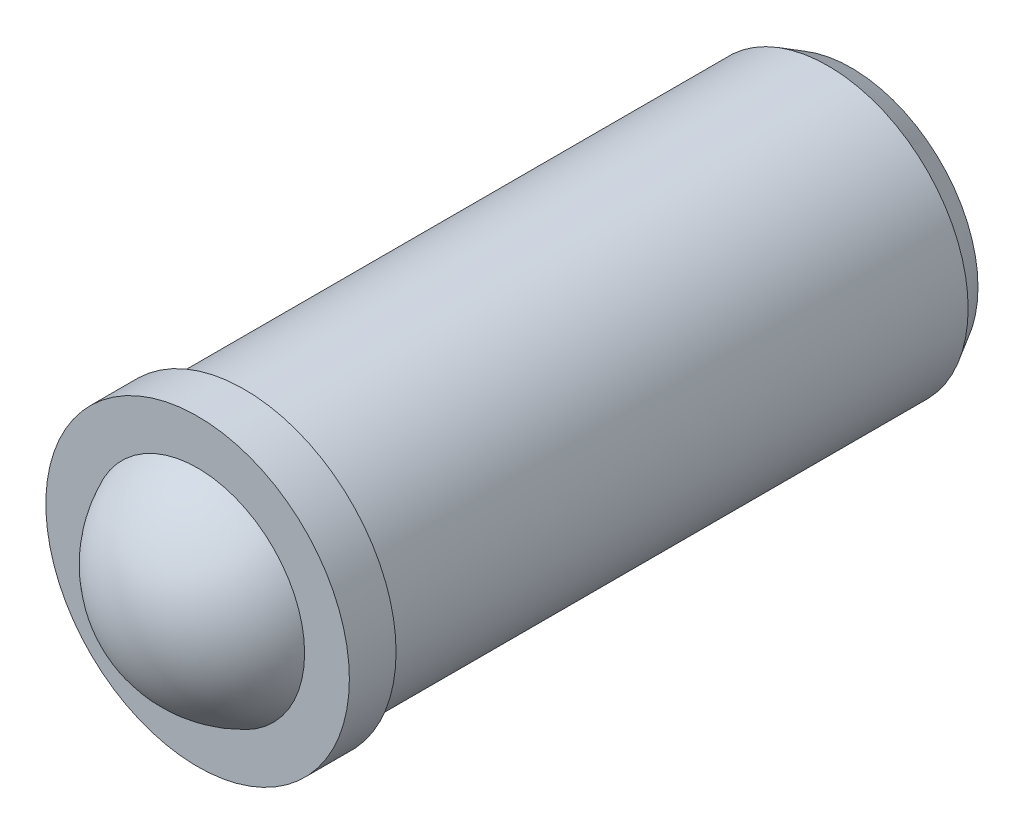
ISO-10303-21;
HEADER;
FILE_DESCRIPTION(('STEP AP214'),'2;1');
FILE_NAME('part.step','',(''),(''),'','','');
FILE_SCHEMA(('AUTOMOTIVE_DESIGN { 1 0 10303 214 1 1 1 1 }'));
ENDSEC;
DATA;
#1=APPLICATION_CONTEXT('core data for automotive mechanical design processes');
#2=APPLICATION_PROTOCOL_DEFINITION('international standard','automotive_design',2000,#1);
#3=PRODUCT_CONTEXT('',#1,'mechanical');
#4=PRODUCT('Part','Part','',(#3));
#5=PRODUCT_RELATED_PRODUCT_CATEGORY('part','',(#4));
#6=PRODUCT_DEFINITION_FORMATION('','',#4);
#7=PRODUCT_DEFINITION_CONTEXT('part definition',#1,'design');
#8=PRODUCT_DEFINITION('design','',#6,#7);
#9=PRODUCT_DEFINITION_SHAPE('','',#8);
#10=(LENGTH_UNIT() NAMED_UNIT(*) SI_UNIT(.MILLI.,.METRE.));
#11=(NAMED_UNIT(*) PLANE_ANGLE_UNIT() SI_UNIT($,.RADIAN.));
#12=(NAMED_UNIT(*) SI_UNIT($,.STERADIAN.) SOLID_ANGLE_UNIT());
#13=UNCERTAINTY_MEASURE_WITH_UNIT(LENGTH_MEASURE(1.E-05),#10,'distance_accuracy_value','');
#14=(GEOMETRIC_REPRESENTATION_CONTEXT(3) GLOBAL_UNCERTAINTY_ASSIGNED_CONTEXT((#13)) GLOBAL_UNIT_ASSIGNED_CONTEXT((#10,
#11,#12)) REPRESENTATION_CONTEXT('',''));
#15=CARTESIAN_POINT('',(0.,0.,0.));
#16=DIRECTION('',(0.,0.,1.));
#17=DIRECTION('',(1.,0.,0.));
#18=AXIS2_PLACEMENT_3D('',#15,#16,#17);
#19=CARTESIAN_POINT('',(0.,0.,0.));
#20=DIRECTION('',(1.,0.,0.));
#21=DIRECTION('',(0.,0.,-1.));
#22=AXIS2_PLACEMENT_3D('',#19,#20,#21);
#23=SPHERICAL_SURFACE('',#22,2.5);
#24=CARTESIAN_POINT('',(0.,0.,0.));
#25=DIRECTION('',(0.,0.,1.));
#26=DIRECTION('',(1.,0.,0.));
#27=AXIS2_PLACEMENT_3D('',#24,#25,#26);
#28=SPHERICAL_SURFACE('',#27,2.5);
#29=CARTESIAN_POINT('',(0.,0.,1.));
#30=DIRECTION('',(0.,0.,1.));
#31=DIRECTION('',(1.,0.,0.));
#32=AXIS2_PLACEMENT_3D('',#29,#30,#31);
#33=CIRCLE('',#32,2.29128784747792);
#34=CARTESIAN_POINT('',(2.29128784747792,0.,1.));
#35=VERTEX_POINT('',#34);
#36=EDGE_CURVE('E26',#35,#35,#33,.T.);
#37=ORIENTED_EDGE('',*,*,#36,.T.);
#38=EDGE_LOOP('',(#37));
#39=FACE_BOUND('',#38,.T.);
#40=ADVANCED_FACE('F12',(#39),#28,.T.);
#41=CARTESIAN_POINT('',(0.,0.,5.));
#42=DIRECTION('',(0.,0.,1.));
#43=DIRECTION('',(1.,0.,0.));
#44=AXIS2_PLACEMENT_3D('',#41,#42,#43);
#45=CYLINDRICAL_SURFACE('',#44,3.);
#46=CARTESIAN_POINT('',(0.,0.,0.));
#47=DIRECTION('',(0.,0.,1.));
#48=DIRECTION('',(1.,0.,0.));
#49=AXIS2_PLACEMENT_3D('',#46,#47,#48);
#50=CIRCLE('',#49,3.);
#51=CARTESIAN_POINT('',(3.,0.,0.));
#52=VERTEX_POINT('',#51);
#53=EDGE_CURVE('E8',#52,#52,#50,.T.);
#54=ORIENTED_EDGE('',*,*,#53,.F.);
#55=EDGE_LOOP('',(#54));
#56=FACE_BOUND('',#55,.T.);
#57=CARTESIAN_POINT('',(0.,0.,-12.5));
#58=DIRECTION('',(0.,0.,1.));
#59=DIRECTION('',(1.,0.,0.));
#60=AXIS2_PLACEMENT_3D('',#57,#58,#59);
#61=CIRCLE('',#60,3.);
#62=CARTESIAN_POINT('',(3.,0.,-12.5));
#63=VERTEX_POINT('',#62);
#64=EDGE_CURVE('E31',#63,#63,#61,.T.);
#65=ORIENTED_EDGE('',*,*,#64,.T.);
#66=EDGE_LOOP('',(#65));
#67=FACE_BOUND('',#66,.T.);
#68=ADVANCED_FACE('F52',(#56,#67),#45,.T.);
#69=CARTESIAN_POINT('',(0.,3.,0.));
#70=DIRECTION('',(0.,0.,1.));
#71=DIRECTION('',(1.,0.,0.));
#72=AXIS2_PLACEMENT_3D('',#69,#70,#71);
#73=PLANE('',#72);
#74=CARTESIAN_POINT('',(0.,0.,0.));
#75=DIRECTION('',(0.,0.,1.));
#76=DIRECTION('',(1.,0.,0.));
#77=AXIS2_PLACEMENT_3D('',#74,#75,#76);
#78=CIRCLE('',#77,3.25);
#79=CARTESIAN_POINT('',(3.25,0.,0.));
#80=VERTEX_POINT('',#79);
#81=EDGE_CURVE('E18',#80,#80,#78,.T.);
#82=ORIENTED_EDGE('',*,*,#81,.F.);
#83=EDGE_LOOP('',(#82));
#84=FACE_BOUND('',#83,.T.);
#85=ORIENTED_EDGE('',*,*,#53,.T.);
#86=EDGE_LOOP('',(#85));
#87=FACE_BOUND('',#86,.T.);
#88=ADVANCED_FACE('F58',(#84,#87),#73,.F.);
#89=CARTESIAN_POINT('',(0.,0.,5.));
#90=DIRECTION('',(0.,0.,1.));
#91=DIRECTION('',(1.,0.,0.));
#92=AXIS2_PLACEMENT_3D('',#89,#90,#91);
#93=CYLINDRICAL_SURFACE('',#92,3.25);
#94=CARTESIAN_POINT('',(0.,0.,1.));
#95=DIRECTION('',(0.,0.,1.));
#96=DIRECTION('',(1.,0.,0.));
#97=AXIS2_PLACEMENT_3D('',#94,#95,#96);
#98=CIRCLE('',#97,3.25);
#99=CARTESIAN_POINT('',(3.25,0.,1.));
#100=VERTEX_POINT('',#99);
#101=EDGE_CURVE('E22',#100,#100,#98,.T.);
#102=ORIENTED_EDGE('',*,*,#101,.F.);
#103=EDGE_LOOP('',(#102));
#104=FACE_BOUND('',#103,.T.);
#105=ORIENTED_EDGE('',*,*,#81,.T.);
#106=EDGE_LOOP('',(#105));
#107=FACE_BOUND('',#106,.T.);
#108=ADVANCED_FACE('F64',(#104,#107),#93,.T.);
#109=CARTESIAN_POINT('',(0.,3.25,1.));
#110=DIRECTION('',(0.,0.,-1.));
#111=DIRECTION('',(-1.,0.,0.));
#112=AXIS2_PLACEMENT_3D('',#109,#110,#111);
#113=PLANE('',#112);
#114=ORIENTED_EDGE('',*,*,#36,.F.);
#115=EDGE_LOOP('',(#114));
#116=FACE_BOUND('',#115,.T.);
#117=ORIENTED_EDGE('',*,*,#101,.T.);
#118=EDGE_LOOP('',(#117));
#119=FACE_BOUND('',#118,.T.);
#120=ADVANCED_FACE('F48',(#116,#119),#113,.F.);
#121=CARTESIAN_POINT('',(0.,0.,-13.));
#122=DIRECTION('',(0.,0.,1.));
#123=DIRECTION('',(1.,0.,0.));
#124=AXIS2_PLACEMENT_3D('',#121,#122,#123);
#125=CONICAL_SURFACE('',#124,2.71132486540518,0.523598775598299);
#126=ORIENTED_EDGE('',*,*,#64,.F.);
#127=EDGE_LOOP('',(#126));
#128=FACE_BOUND('',#127,.T.);
#129=CARTESIAN_POINT('',(0.,0.,-13.));
#130=DIRECTION('',(0.,0.,1.));
#131=DIRECTION('',(1.,0.,0.));
#132=AXIS2_PLACEMENT_3D('',#129,#130,#131);
#133=CIRCLE('',#132,2.71132486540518);
#134=CARTESIAN_POINT('',(2.71132486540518,0.,-13.));
#135=VERTEX_POINT('',#134);
#136=EDGE_CURVE('E34',#135,#135,#133,.T.);
#137=ORIENTED_EDGE('',*,*,#136,.T.);
#138=EDGE_LOOP('',(#137));
#139=FACE_BOUND('',#138,.T.);
#140=ADVANCED_FACE('F38',(#128,#139),#125,.T.);
#141=CARTESIAN_POINT('',(-2.71132486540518,0.,-13.));
#142=DIRECTION('',(0.,0.,1.));
#143=DIRECTION('',(1.,0.,0.));
#144=AXIS2_PLACEMENT_3D('',#141,#142,#143);
#145=PLANE('',#144);
#146=ORIENTED_EDGE('',*,*,#136,.F.);
#147=EDGE_LOOP('',(#146));
#148=FACE_BOUND('',#147,.T.);
#149=ADVANCED_FACE('F40',(#148),#145,.F.);
#150=CLOSED_SHELL('',(#40,#68,#88,#108,#120,#140,#149));
#151=MANIFOLD_SOLID_BREP('B1',#150);
#152=ADVANCED_BREP_SHAPE_REPRESENTATION('',(#18,#151),#14);
#153=SHAPE_DEFINITION_REPRESENTATION(#9,#152);
ENDSEC;
END-ISO-10303-21;
